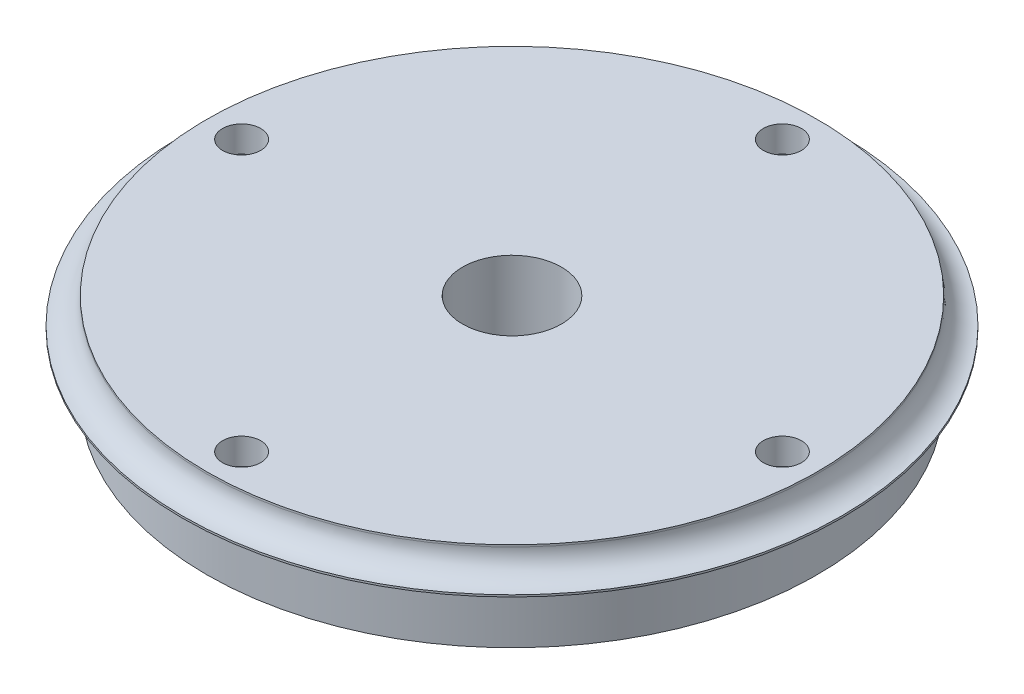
ISO-10303-21;
HEADER;
FILE_DESCRIPTION(('STEP AP214'),'2;1');
FILE_NAME('part.step','',(''),(''),'','','');
FILE_SCHEMA(('AUTOMOTIVE_DESIGN { 1 0 10303 214 1 1 1 1 }'));
ENDSEC;
DATA;
#1=APPLICATION_CONTEXT('core data for automotive mechanical design processes');
#2=APPLICATION_PROTOCOL_DEFINITION('international standard','automotive_design',2000,#1);
#3=PRODUCT_CONTEXT('',#1,'mechanical');
#4=PRODUCT('Part','Part','',(#3));
#5=PRODUCT_RELATED_PRODUCT_CATEGORY('part','',(#4));
#6=PRODUCT_DEFINITION_FORMATION('','',#4);
#7=PRODUCT_DEFINITION_CONTEXT('part definition',#1,'design');
#8=PRODUCT_DEFINITION('design','',#6,#7);
#9=PRODUCT_DEFINITION_SHAPE('','',#8);
#10=(LENGTH_UNIT() NAMED_UNIT(*) SI_UNIT(.MILLI.,.METRE.));
#11=(NAMED_UNIT(*) PLANE_ANGLE_UNIT() SI_UNIT($,.RADIAN.));
#12=(NAMED_UNIT(*) SI_UNIT($,.STERADIAN.) SOLID_ANGLE_UNIT());
#13=UNCERTAINTY_MEASURE_WITH_UNIT(LENGTH_MEASURE(1.E-05),#10,'distance_accuracy_value','');
#14=(GEOMETRIC_REPRESENTATION_CONTEXT(3) GLOBAL_UNCERTAINTY_ASSIGNED_CONTEXT((#13)) GLOBAL_UNIT_ASSIGNED_CONTEXT((#10,
#11,#12)) REPRESENTATION_CONTEXT('',''));
#15=CARTESIAN_POINT('',(0.,0.,0.));
#16=DIRECTION('',(0.,0.,1.));
#17=DIRECTION('',(1.,0.,0.));
#18=AXIS2_PLACEMENT_3D('',#15,#16,#17);
#19=CARTESIAN_POINT('',(0.,-11.684,0.));
#20=DIRECTION('',(0.,1.,0.));
#21=DIRECTION('',(0.,0.,1.));
#22=AXIS2_PLACEMENT_3D('',#19,#20,#21);
#23=CYLINDRICAL_SURFACE('',#22,40.005);
#24=CARTESIAN_POINT('',(0.,-11.684,0.));
#25=DIRECTION('',(0.,1.,0.));
#26=DIRECTION('',(0.,0.,1.));
#27=AXIS2_PLACEMENT_3D('',#24,#25,#26);
#28=CIRCLE('',#27,40.005);
#29=CARTESIAN_POINT('',(0.,-11.684,40.005));
#30=VERTEX_POINT('',#29);
#31=EDGE_CURVE('E89',#30,#30,#28,.T.);
#32=ORIENTED_EDGE('',*,*,#31,.T.);
#33=EDGE_LOOP('',(#32));
#34=FACE_BOUND('',#33,.T.);
#35=CARTESIAN_POINT('',(0.,-3.683,0.));
#36=DIRECTION('',(0.,1.,0.));
#37=DIRECTION('',(0.,0.,1.));
#38=AXIS2_PLACEMENT_3D('',#35,#36,#37);
#39=CIRCLE('',#38,40.005);
#40=CARTESIAN_POINT('',(0.,-3.683,40.005));
#41=VERTEX_POINT('',#40);
#42=EDGE_CURVE('E54',#41,#41,#39,.F.);
#43=ORIENTED_EDGE('',*,*,#42,.T.);
#44=EDGE_LOOP('',(#43));
#45=FACE_BOUND('',#44,.T.);
#46=ADVANCED_FACE('F34',(#34,#45),#23,.T.);
#47=CARTESIAN_POINT('',(0.,0.,-35.433));
#48=DIRECTION('',(0.,1.,0.));
#49=DIRECTION('',(0.,0.,1.));
#50=AXIS2_PLACEMENT_3D('',#47,#48,#49);
#51=CYLINDRICAL_SURFACE('',#50,2.49999999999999);
#52=CARTESIAN_POINT('',(0.,-11.684,-35.433));
#53=DIRECTION('',(0.,1.,0.));
#54=DIRECTION('',(0.,0.,1.));
#55=AXIS2_PLACEMENT_3D('',#52,#53,#54);
#56=CIRCLE('',#55,2.49999999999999);
#57=CARTESIAN_POINT('',(0.,-11.684,-32.933));
#58=VERTEX_POINT('',#57);
#59=EDGE_CURVE('E85',#58,#58,#56,.T.);
#60=ORIENTED_EDGE('',*,*,#59,.F.);
#61=EDGE_LOOP('',(#60));
#62=FACE_BOUND('',#61,.T.);
#63=CARTESIAN_POINT('',(0.,-3.683,-35.433));
#64=DIRECTION('',(0.,1.,0.));
#65=DIRECTION('',(0.,0.,1.));
#66=AXIS2_PLACEMENT_3D('',#63,#64,#65);
#67=CIRCLE('',#66,2.49999999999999);
#68=CARTESIAN_POINT('',(0.,-3.683,-32.933));
#69=VERTEX_POINT('',#68);
#70=EDGE_CURVE('E41',#69,#69,#67,.F.);
#71=ORIENTED_EDGE('',*,*,#70,.F.);
#72=EDGE_LOOP('',(#71));
#73=FACE_BOUND('',#72,.T.);
#74=ADVANCED_FACE('F108',(#62,#73),#51,.F.);
#75=CARTESIAN_POINT('',(-35.433,0.,1.23713658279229E-13));
#76=DIRECTION('',(0.,1.,0.));
#77=DIRECTION('',(0.,0.,1.));
#78=AXIS2_PLACEMENT_3D('',#75,#76,#77);
#79=CYLINDRICAL_SURFACE('',#78,2.49999999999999);
#80=CARTESIAN_POINT('',(-35.433,-11.684,1.23713658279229E-13));
#81=DIRECTION('',(0.,1.,0.));
#82=DIRECTION('',(0.,0.,1.));
#83=AXIS2_PLACEMENT_3D('',#80,#81,#82);
#84=CIRCLE('',#83,2.49999999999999);
#85=CARTESIAN_POINT('',(-35.433,-11.684,2.50000000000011));
#86=VERTEX_POINT('',#85);
#87=EDGE_CURVE('E79',#86,#86,#84,.T.);
#88=ORIENTED_EDGE('',*,*,#87,.F.);
#89=EDGE_LOOP('',(#88));
#90=FACE_BOUND('',#89,.T.);
#91=CARTESIAN_POINT('',(-35.433,-3.683,1.23713658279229E-13));
#92=DIRECTION('',(0.,1.,0.));
#93=DIRECTION('',(0.,0.,1.));
#94=AXIS2_PLACEMENT_3D('',#91,#92,#93);
#95=CIRCLE('',#94,2.49999999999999);
#96=CARTESIAN_POINT('',(-35.433,-3.683,2.50000000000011));
#97=VERTEX_POINT('',#96);
#98=EDGE_CURVE('E45',#97,#97,#95,.F.);
#99=ORIENTED_EDGE('',*,*,#98,.F.);
#100=EDGE_LOOP('',(#99));
#101=FACE_BOUND('',#100,.T.);
#102=ADVANCED_FACE('F120',(#90,#101),#79,.F.);
#103=CARTESIAN_POINT('',(0.,0.,35.433));
#104=DIRECTION('',(0.,1.,0.));
#105=DIRECTION('',(0.,0.,1.));
#106=AXIS2_PLACEMENT_3D('',#103,#104,#105);
#107=CYLINDRICAL_SURFACE('',#106,2.49999999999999);
#108=CARTESIAN_POINT('',(0.,-11.684,35.433));
#109=DIRECTION('',(0.,1.,0.));
#110=DIRECTION('',(0.,0.,1.));
#111=AXIS2_PLACEMENT_3D('',#108,#109,#110);
#112=CIRCLE('',#111,2.49999999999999);
#113=CARTESIAN_POINT('',(0.,-11.684,37.933));
#114=VERTEX_POINT('',#113);
#115=EDGE_CURVE('E73',#114,#114,#112,.T.);
#116=ORIENTED_EDGE('',*,*,#115,.F.);
#117=EDGE_LOOP('',(#116));
#118=FACE_BOUND('',#117,.T.);
#119=CARTESIAN_POINT('',(0.,-3.683,35.433));
#120=DIRECTION('',(0.,1.,0.));
#121=DIRECTION('',(0.,0.,1.));
#122=AXIS2_PLACEMENT_3D('',#119,#120,#121);
#123=CIRCLE('',#122,2.49999999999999);
#124=CARTESIAN_POINT('',(0.,-3.683,37.933));
#125=VERTEX_POINT('',#124);
#126=EDGE_CURVE('E50',#125,#125,#123,.F.);
#127=ORIENTED_EDGE('',*,*,#126,.F.);
#128=EDGE_LOOP('',(#127));
#129=FACE_BOUND('',#128,.T.);
#130=ADVANCED_FACE('F152',(#118,#129),#107,.F.);
#131=CARTESIAN_POINT('',(35.433,0.,-3.71140974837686E-13));
#132=DIRECTION('',(0.,1.,0.));
#133=DIRECTION('',(0.,0.,1.));
#134=AXIS2_PLACEMENT_3D('',#131,#132,#133);
#135=CYLINDRICAL_SURFACE('',#134,2.49999999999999);
#136=CARTESIAN_POINT('',(35.433,-11.684,-3.71140974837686E-13));
#137=DIRECTION('',(0.,1.,0.));
#138=DIRECTION('',(0.,0.,1.));
#139=AXIS2_PLACEMENT_3D('',#136,#137,#138);
#140=CIRCLE('',#139,2.49999999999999);
#141=CARTESIAN_POINT('',(35.433,-11.684,2.49999999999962));
#142=VERTEX_POINT('',#141);
#143=EDGE_CURVE('E67',#142,#142,#140,.T.);
#144=ORIENTED_EDGE('',*,*,#143,.F.);
#145=EDGE_LOOP('',(#144));
#146=FACE_BOUND('',#145,.T.);
#147=CARTESIAN_POINT('',(35.433,-3.683,-3.71140974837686E-13));
#148=DIRECTION('',(0.,1.,0.));
#149=DIRECTION('',(0.,0.,1.));
#150=AXIS2_PLACEMENT_3D('',#147,#148,#149);
#151=CIRCLE('',#150,2.49999999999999);
#152=CARTESIAN_POINT('',(35.433,-3.683,2.49999999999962));
#153=VERTEX_POINT('',#152);
#154=EDGE_CURVE('E91',#153,#153,#151,.F.);
#155=ORIENTED_EDGE('',*,*,#154,.F.);
#156=EDGE_LOOP('',(#155));
#157=FACE_BOUND('',#156,.T.);
#158=ADVANCED_FACE('F154',(#146,#157),#135,.F.);
#159=CARTESIAN_POINT('',(0.,-11.684,0.));
#160=DIRECTION('',(0.,1.,0.));
#161=DIRECTION('',(0.,0.,1.));
#162=AXIS2_PLACEMENT_3D('',#159,#160,#161);
#163=PLANE('',#162);
#164=CARTESIAN_POINT('',(0.,-11.684,0.));
#165=DIRECTION('',(0.,1.,0.));
#166=DIRECTION('',(0.,0.,1.));
#167=AXIS2_PLACEMENT_3D('',#164,#165,#166);
#168=CIRCLE('',#167,6.477);
#169=CARTESIAN_POINT('',(0.,-11.684,6.477));
#170=VERTEX_POINT('',#169);
#171=EDGE_CURVE('E59',#170,#170,#168,.T.);
#172=ORIENTED_EDGE('',*,*,#171,.T.);
#173=EDGE_LOOP('',(#172));
#174=FACE_BOUND('',#173,.T.);
#175=ORIENTED_EDGE('',*,*,#143,.T.);
#176=EDGE_LOOP('',(#175));
#177=FACE_BOUND('',#176,.T.);
#178=ORIENTED_EDGE('',*,*,#115,.T.);
#179=EDGE_LOOP('',(#178));
#180=FACE_BOUND('',#179,.T.);
#181=ORIENTED_EDGE('',*,*,#87,.T.);
#182=EDGE_LOOP('',(#181));
#183=FACE_BOUND('',#182,.T.);
#184=ORIENTED_EDGE('',*,*,#59,.T.);
#185=EDGE_LOOP('',(#184));
#186=FACE_BOUND('',#185,.T.);
#187=ORIENTED_EDGE('',*,*,#31,.F.);
#188=EDGE_LOOP('',(#187));
#189=FACE_BOUND('',#188,.T.);
#190=ADVANCED_FACE('F162',(#174,#177,#180,#183,#186,#189),#163,.F.);
#191=CARTESIAN_POINT('',(0.,-3.683,0.));
#192=DIRECTION('',(0.,1.,0.));
#193=DIRECTION('',(0.,0.,1.));
#194=AXIS2_PLACEMENT_3D('',#191,#192,#193);
#195=PLANE('',#194);
#196=ORIENTED_EDGE('',*,*,#154,.T.);
#197=EDGE_LOOP('',(#196));
#198=FACE_BOUND('',#197,.T.);
#199=ADVANCED_FACE('F113',(#198),#195,.F.);
#200=ORIENTED_EDGE('',*,*,#126,.T.);
#201=EDGE_LOOP('',(#200));
#202=FACE_BOUND('',#201,.T.);
#203=ADVANCED_FACE('F150',(#202),#195,.F.);
#204=ORIENTED_EDGE('',*,*,#98,.T.);
#205=EDGE_LOOP('',(#204));
#206=FACE_BOUND('',#205,.T.);
#207=ADVANCED_FACE('F218',(#206),#195,.F.);
#208=ORIENTED_EDGE('',*,*,#70,.T.);
#209=EDGE_LOOP('',(#208));
#210=FACE_BOUND('',#209,.T.);
#211=ADVANCED_FACE('F112',(#210),#195,.F.);
#212=CARTESIAN_POINT('',(0.,-3.683,0.));
#213=DIRECTION('',(0.,1.,0.));
#214=DIRECTION('',(0.,0.,1.));
#215=AXIS2_PLACEMENT_3D('',#212,#213,#214);
#216=CYLINDRICAL_SURFACE('',#215,43.18);
#217=CARTESIAN_POINT('',(0.,-3.683,0.));
#218=DIRECTION('',(0.,1.,0.));
#219=DIRECTION('',(0.,0.,1.));
#220=AXIS2_PLACEMENT_3D('',#217,#218,#219);
#221=CIRCLE('',#220,43.18);
#222=CARTESIAN_POINT('',(0.,-3.683,43.18));
#223=VERTEX_POINT('',#222);
#224=EDGE_CURVE('E128',#223,#223,#221,.T.);
#225=ORIENTED_EDGE('',*,*,#224,.T.);
#226=EDGE_LOOP('',(#225));
#227=FACE_BOUND('',#226,.T.);
#228=CARTESIAN_POINT('',(0.,-3.429,0.));
#229=DIRECTION('',(0.,1.,0.));
#230=DIRECTION('',(0.,0.,1.));
#231=AXIS2_PLACEMENT_3D('',#228,#229,#230);
#232=CIRCLE('',#231,43.18);
#233=CARTESIAN_POINT('',(0.,-3.429,43.18));
#234=VERTEX_POINT('',#233);
#235=EDGE_CURVE('E131',#234,#234,#232,.T.);
#236=ORIENTED_EDGE('',*,*,#235,.F.);
#237=EDGE_LOOP('',(#236));
#238=FACE_BOUND('',#237,.T.);
#239=ADVANCED_FACE('F109',(#227,#238),#216,.T.);
#240=ORIENTED_EDGE('',*,*,#42,.F.);
#241=EDGE_LOOP('',(#240));
#242=FACE_BOUND('',#241,.T.);
#243=ORIENTED_EDGE('',*,*,#224,.F.);
#244=EDGE_LOOP('',(#243));
#245=FACE_BOUND('',#244,.T.);
#246=ADVANCED_FACE('F100',(#242,#245),#195,.F.);
#247=CARTESIAN_POINT('',(0.,-0.254000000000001,0.));
#248=DIRECTION('',(0.,1.,0.));
#249=DIRECTION('',(0.,0.,1.));
#250=AXIS2_PLACEMENT_3D('',#247,#248,#249);
#251=CIRCLE('',#250,40.005);
#252=CARTESIAN_POINT('',(0.,-0.254000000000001,40.005));
#253=VERTEX_POINT('',#252);
#254=EDGE_CURVE('E10',#253,#253,#251,.T.);
#255=ORIENTED_EDGE('',*,*,#254,.T.);
#256=EDGE_LOOP('',(#255));
#257=FACE_BOUND('',#256,.T.);
#258=CARTESIAN_POINT('',(0.,0.,0.));
#259=DIRECTION('',(0.,1.,0.));
#260=DIRECTION('',(0.,0.,1.));
#261=AXIS2_PLACEMENT_3D('',#258,#259,#260);
#262=CIRCLE('',#261,40.005);
#263=CARTESIAN_POINT('',(0.,0.,40.005));
#264=VERTEX_POINT('',#263);
#265=EDGE_CURVE('E88',#264,#264,#262,.T.);
#266=ORIENTED_EDGE('',*,*,#265,.F.);
#267=EDGE_LOOP('',(#266));
#268=FACE_BOUND('',#267,.T.);
#269=ADVANCED_FACE('F97',(#257,#268),#23,.T.);
#270=CARTESIAN_POINT('',(0.,-3.429,-35.433));
#271=DIRECTION('',(0.,1.,0.));
#272=DIRECTION('',(0.,0.,1.));
#273=AXIS2_PLACEMENT_3D('',#270,#271,#272);
#274=CIRCLE('',#273,2.49999999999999);
#275=CARTESIAN_POINT('',(0.,-3.429,-32.933));
#276=VERTEX_POINT('',#275);
#277=EDGE_CURVE('E58',#276,#276,#274,.F.);
#278=ORIENTED_EDGE('',*,*,#277,.T.);
#279=EDGE_LOOP('',(#278));
#280=FACE_BOUND('',#279,.T.);
#281=CARTESIAN_POINT('',(0.,0.,-35.433));
#282=DIRECTION('',(0.,1.,0.));
#283=DIRECTION('',(0.,0.,1.));
#284=AXIS2_PLACEMENT_3D('',#281,#282,#283);
#285=CIRCLE('',#284,2.49999999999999);
#286=CARTESIAN_POINT('',(0.,0.,-32.933));
#287=VERTEX_POINT('',#286);
#288=EDGE_CURVE('E82',#287,#287,#285,.T.);
#289=ORIENTED_EDGE('',*,*,#288,.T.);
#290=EDGE_LOOP('',(#289));
#291=FACE_BOUND('',#290,.T.);
#292=ADVANCED_FACE('F99',(#280,#291),#51,.F.);
#293=CARTESIAN_POINT('',(-35.433,-3.429,1.23713658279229E-13));
#294=DIRECTION('',(0.,1.,0.));
#295=DIRECTION('',(0.,0.,1.));
#296=AXIS2_PLACEMENT_3D('',#293,#294,#295);
#297=CIRCLE('',#296,2.49999999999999);
#298=CARTESIAN_POINT('',(-35.433,-3.429,2.50000000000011));
#299=VERTEX_POINT('',#298);
#300=EDGE_CURVE('E141',#299,#299,#297,.F.);
#301=ORIENTED_EDGE('',*,*,#300,.T.);
#302=EDGE_LOOP('',(#301));
#303=FACE_BOUND('',#302,.T.);
#304=CARTESIAN_POINT('',(-35.433,0.,1.23713658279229E-13));
#305=DIRECTION('',(0.,1.,0.));
#306=DIRECTION('',(0.,0.,1.));
#307=AXIS2_PLACEMENT_3D('',#304,#305,#306);
#308=CIRCLE('',#307,2.49999999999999);
#309=CARTESIAN_POINT('',(-35.433,0.,2.50000000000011));
#310=VERTEX_POINT('',#309);
#311=EDGE_CURVE('E76',#310,#310,#308,.T.);
#312=ORIENTED_EDGE('',*,*,#311,.T.);
#313=EDGE_LOOP('',(#312));
#314=FACE_BOUND('',#313,.T.);
#315=ADVANCED_FACE('F105',(#303,#314),#79,.F.);
#316=CARTESIAN_POINT('',(0.,-3.429,35.433));
#317=DIRECTION('',(0.,1.,0.));
#318=DIRECTION('',(0.,0.,1.));
#319=AXIS2_PLACEMENT_3D('',#316,#317,#318);
#320=CIRCLE('',#319,2.49999999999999);
#321=CARTESIAN_POINT('',(0.,-3.429,37.933));
#322=VERTEX_POINT('',#321);
#323=EDGE_CURVE('E134',#322,#322,#320,.F.);
#324=ORIENTED_EDGE('',*,*,#323,.T.);
#325=EDGE_LOOP('',(#324));
#326=FACE_BOUND('',#325,.T.);
#327=CARTESIAN_POINT('',(0.,0.,35.433));
#328=DIRECTION('',(0.,1.,0.));
#329=DIRECTION('',(0.,0.,1.));
#330=AXIS2_PLACEMENT_3D('',#327,#328,#329);
#331=CIRCLE('',#330,2.49999999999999);
#332=CARTESIAN_POINT('',(0.,0.,37.933));
#333=VERTEX_POINT('',#332);
#334=EDGE_CURVE('E70',#333,#333,#331,.T.);
#335=ORIENTED_EDGE('',*,*,#334,.T.);
#336=EDGE_LOOP('',(#335));
#337=FACE_BOUND('',#336,.T.);
#338=ADVANCED_FACE('F157',(#326,#337),#107,.F.);
#339=CARTESIAN_POINT('',(35.433,-3.429,-3.71140974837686E-13));
#340=DIRECTION('',(0.,1.,0.));
#341=DIRECTION('',(0.,0.,1.));
#342=AXIS2_PLACEMENT_3D('',#339,#340,#341);
#343=CIRCLE('',#342,2.49999999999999);
#344=CARTESIAN_POINT('',(35.433,-3.429,2.49999999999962));
#345=VERTEX_POINT('',#344);
#346=EDGE_CURVE('E130',#345,#345,#343,.F.);
#347=ORIENTED_EDGE('',*,*,#346,.T.);
#348=EDGE_LOOP('',(#347));
#349=FACE_BOUND('',#348,.T.);
#350=CARTESIAN_POINT('',(35.433,0.,-3.71140974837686E-13));
#351=DIRECTION('',(0.,1.,0.));
#352=DIRECTION('',(0.,0.,1.));
#353=AXIS2_PLACEMENT_3D('',#350,#351,#352);
#354=CIRCLE('',#353,2.49999999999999);
#355=CARTESIAN_POINT('',(35.433,0.,2.49999999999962));
#356=VERTEX_POINT('',#355);
#357=EDGE_CURVE('E62',#356,#356,#354,.T.);
#358=ORIENTED_EDGE('',*,*,#357,.T.);
#359=EDGE_LOOP('',(#358));
#360=FACE_BOUND('',#359,.T.);
#361=ADVANCED_FACE('F165',(#349,#360),#135,.F.);
#362=CARTESIAN_POINT('',(0.,0.,0.));
#363=DIRECTION('',(0.,1.,0.));
#364=DIRECTION('',(0.,0.,1.));
#365=AXIS2_PLACEMENT_3D('',#362,#363,#364);
#366=PLANE('',#365);
#367=CARTESIAN_POINT('',(0.,0.,0.));
#368=DIRECTION('',(0.,1.,0.));
#369=DIRECTION('',(0.,0.,1.));
#370=AXIS2_PLACEMENT_3D('',#367,#368,#369);
#371=CIRCLE('',#370,6.477);
#372=CARTESIAN_POINT('',(0.,0.,6.477));
#373=VERTEX_POINT('',#372);
#374=EDGE_CURVE('E57',#373,#373,#371,.T.);
#375=ORIENTED_EDGE('',*,*,#374,.F.);
#376=EDGE_LOOP('',(#375));
#377=FACE_BOUND('',#376,.T.);
#378=ORIENTED_EDGE('',*,*,#357,.F.);
#379=EDGE_LOOP('',(#378));
#380=FACE_BOUND('',#379,.T.);
#381=ORIENTED_EDGE('',*,*,#334,.F.);
#382=EDGE_LOOP('',(#381));
#383=FACE_BOUND('',#382,.T.);
#384=ORIENTED_EDGE('',*,*,#311,.F.);
#385=EDGE_LOOP('',(#384));
#386=FACE_BOUND('',#385,.T.);
#387=ORIENTED_EDGE('',*,*,#288,.F.);
#388=EDGE_LOOP('',(#387));
#389=FACE_BOUND('',#388,.T.);
#390=ORIENTED_EDGE('',*,*,#265,.T.);
#391=EDGE_LOOP('',(#390));
#392=FACE_BOUND('',#391,.T.);
#393=ADVANCED_FACE('F95',(#377,#380,#383,#386,#389,#392),#366,.T.);
#394=CARTESIAN_POINT('',(0.,-11.684,0.));
#395=DIRECTION('',(0.,1.,0.));
#396=DIRECTION('',(0.,0.,1.));
#397=AXIS2_PLACEMENT_3D('',#394,#395,#396);
#398=CYLINDRICAL_SURFACE('',#397,6.477);
#399=ORIENTED_EDGE('',*,*,#374,.T.);
#400=EDGE_LOOP('',(#399));
#401=FACE_BOUND('',#400,.T.);
#402=ORIENTED_EDGE('',*,*,#171,.F.);
#403=EDGE_LOOP('',(#402));
#404=FACE_BOUND('',#403,.T.);
#405=ADVANCED_FACE('F183',(#401,#404),#398,.F.);
#406=CARTESIAN_POINT('',(0.,-3.429,0.));
#407=DIRECTION('',(0.,1.,0.));
#408=DIRECTION('',(0.,0.,1.));
#409=AXIS2_PLACEMENT_3D('',#406,#407,#408);
#410=PLANE('',#409);
#411=ORIENTED_EDGE('',*,*,#346,.F.);
#412=EDGE_LOOP('',(#411));
#413=FACE_BOUND('',#412,.T.);
#414=ADVANCED_FACE('F193',(#413),#410,.T.);
#415=ORIENTED_EDGE('',*,*,#323,.F.);
#416=EDGE_LOOP('',(#415));
#417=FACE_BOUND('',#416,.T.);
#418=ADVANCED_FACE('F252',(#417),#410,.T.);
#419=ORIENTED_EDGE('',*,*,#300,.F.);
#420=EDGE_LOOP('',(#419));
#421=FACE_BOUND('',#420,.T.);
#422=ADVANCED_FACE('F228',(#421),#410,.T.);
#423=ORIENTED_EDGE('',*,*,#277,.F.);
#424=EDGE_LOOP('',(#423));
#425=FACE_BOUND('',#424,.T.);
#426=ADVANCED_FACE('F225',(#425),#410,.T.);
#427=CARTESIAN_POINT('',(0.,-0.254000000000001,0.));
#428=DIRECTION('',(0.,1.,0.));
#429=DIRECTION('',(0.,0.,1.));
#430=AXIS2_PLACEMENT_3D('',#427,#428,#429);
#431=TOROIDAL_SURFACE('',#430,43.18,3.175);
#432=ORIENTED_EDGE('',*,*,#254,.F.);
#433=EDGE_LOOP('',(#432));
#434=FACE_BOUND('',#433,.T.);
#435=ORIENTED_EDGE('',*,*,#235,.T.);
#436=EDGE_LOOP('',(#435));
#437=FACE_BOUND('',#436,.T.);
#438=ADVANCED_FACE('F36',(#434,#437),#431,.F.);
#439=CLOSED_SHELL('',(#46,#74,#102,#130,#158,#190,#199,#203,#207,#211,#239,#246,#269,#292,#315,
#338,#361,#393,#405,#414,#418,#422,#426,#438));
#440=MANIFOLD_SOLID_BREP('B2',#439);
#441=ADVANCED_BREP_SHAPE_REPRESENTATION('',(#18,#440),#14);
#442=SHAPE_DEFINITION_REPRESENTATION(#9,#441);
ENDSEC;
END-ISO-10303-21;
